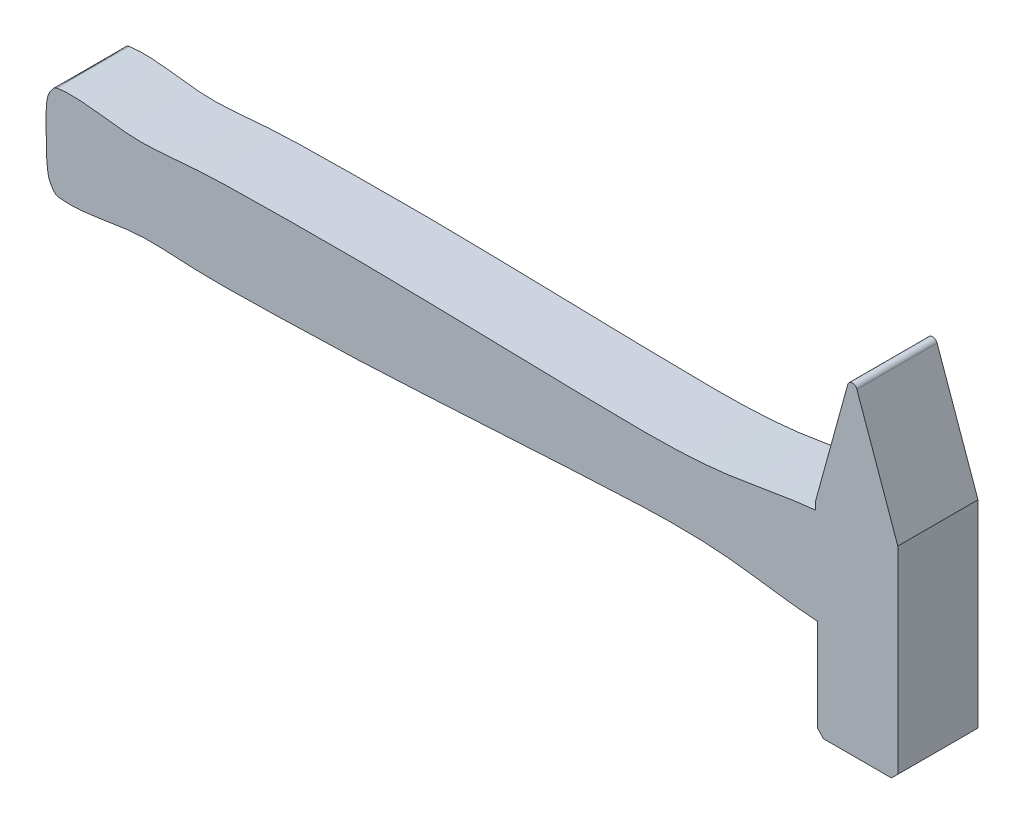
ISO-10303-21;
HEADER;
FILE_DESCRIPTION(('STEP AP214'),'2;1');
FILE_NAME('part.step','',(''),(''),'','','');
FILE_SCHEMA(('AUTOMOTIVE_DESIGN { 1 0 10303 214 1 1 1 1 }'));
ENDSEC;
DATA;
#1=APPLICATION_CONTEXT('core data for automotive mechanical design processes');
#2=APPLICATION_PROTOCOL_DEFINITION('international standard','automotive_design',2000,#1);
#3=PRODUCT_CONTEXT('',#1,'mechanical');
#4=PRODUCT('Part','Part','',(#3));
#5=PRODUCT_RELATED_PRODUCT_CATEGORY('part','',(#4));
#6=PRODUCT_DEFINITION_FORMATION('','',#4);
#7=PRODUCT_DEFINITION_CONTEXT('part definition',#1,'design');
#8=PRODUCT_DEFINITION('design','',#6,#7);
#9=PRODUCT_DEFINITION_SHAPE('','',#8);
#10=(LENGTH_UNIT() NAMED_UNIT(*) SI_UNIT(.MILLI.,.METRE.));
#11=(NAMED_UNIT(*) PLANE_ANGLE_UNIT() SI_UNIT($,.RADIAN.));
#12=(NAMED_UNIT(*) SI_UNIT($,.STERADIAN.) SOLID_ANGLE_UNIT());
#13=UNCERTAINTY_MEASURE_WITH_UNIT(LENGTH_MEASURE(1.E-05),#10,'distance_accuracy_value','');
#14=(GEOMETRIC_REPRESENTATION_CONTEXT(3) GLOBAL_UNCERTAINTY_ASSIGNED_CONTEXT((#13)) GLOBAL_UNIT_ASSIGNED_CONTEXT((#10,
#11,#12)) REPRESENTATION_CONTEXT('',''));
#15=CARTESIAN_POINT('',(0.,0.,0.));
#16=DIRECTION('',(0.,0.,1.));
#17=DIRECTION('',(1.,0.,0.));
#18=AXIS2_PLACEMENT_3D('',#15,#16,#17);
#19=CARTESIAN_POINT('',(-0.68450806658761,78.1907628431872,33.4));
#20=CARTESIAN_POINT('',(-13.6434926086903,76.9835073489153,33.4));
#21=CARTESIAN_POINT('',(-33.3766329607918,72.3930161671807,33.4));
#22=CARTESIAN_POINT('',(-62.7810656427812,70.5584136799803,33.4));
#23=CARTESIAN_POINT('',(-93.440673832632,70.9978990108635,33.4));
#24=CARTESIAN_POINT('',(-138.176641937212,71.9057039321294,33.4));
#25=CARTESIAN_POINT('',(-185.927046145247,73.2892298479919,33.4));
#26=CARTESIAN_POINT('',(-229.529665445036,72.8733691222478,33.4));
#27=CARTESIAN_POINT('',(-259.40709066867,72.4489903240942,33.4));
#28=CARTESIAN_POINT('',(-283.728884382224,69.4231372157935,33.4));
#29=CARTESIAN_POINT('',(-301.923274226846,72.7541457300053,33.4));
#30=CARTESIAN_POINT('',(-312.704353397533,73.0430645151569,33.4));
#31=CARTESIAN_POINT('',(-316.828381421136,72.4242011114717,33.4));
#32=B_SPLINE_CURVE_WITH_KNOTS('',3,(#19,#20,#21,#22,#23,#24,#25,#26,#27,#28,#29,#30,#31),
.UNSPECIFIED.,.F.,.F.,(4,1,1,1,1,1,1,1,1,1,4),(0.,0.123173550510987,0.190951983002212,
0.27844417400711,0.413498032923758,0.614695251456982,0.730775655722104,0.826275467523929,
0.897914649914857,0.961054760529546,1.),.UNSPECIFIED.);
#33=DIRECTION('',(0.,0.,-1.));
#34=VECTOR('',#33,1.);
#35=SURFACE_OF_LINEAR_EXTRUSION('',#32,#34);
#36=CARTESIAN_POINT('',(-316.828381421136,72.4242011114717,3.33));
#37=CARTESIAN_POINT('',(-316.334623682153,72.4983284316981,3.33));
#38=CARTESIAN_POINT('',(-315.839387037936,72.5621855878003,3.33));
#39=CARTESIAN_POINT('',(-314.849201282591,72.670468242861,3.33));
#40=CARTESIAN_POINT('',(-314.354262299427,72.7149859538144,3.33));
#41=CARTESIAN_POINT('',(-313.3647027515,72.7862738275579,3.33));
#42=CARTESIAN_POINT('',(-312.870086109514,72.8130995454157,3.33));
#43=CARTESIAN_POINT('',(-311.881159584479,72.8507289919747,3.33));
#44=CARTESIAN_POINT('',(-311.386850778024,72.8615617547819,3.33));
#45=CARTESIAN_POINT('',(-310.398535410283,72.8689061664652,3.33));
#46=CARTESIAN_POINT('',(-309.904528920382,72.8654291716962,3.33));
#47=CARTESIAN_POINT('',(-308.916809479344,72.8458492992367,3.33));
#48=CARTESIAN_POINT('',(-308.423096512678,72.8297471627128,3.33));
#49=CARTESIAN_POINT('',(-307.436091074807,72.7866145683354,3.33));
#50=CARTESIAN_POINT('',(-306.942798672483,72.7595825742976,3.33));
#51=CARTESIAN_POINT('',(-305.956446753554,72.6962603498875,3.33));
#52=CARTESIAN_POINT('',(-305.463387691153,72.6599631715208,3.33));
#53=CARTESIAN_POINT('',(-304.477458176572,72.579827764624,3.33));
#54=CARTESIAN_POINT('',(-303.984588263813,72.5359829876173,3.33));
#55=CARTESIAN_POINT('',(-302.999019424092,72.4421601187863,3.33));
#56=CARTESIAN_POINT('',(-302.506320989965,72.3921768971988,3.33));
#57=CARTESIAN_POINT('',(-301.521092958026,72.2873499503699,3.33));
#58=CARTESIAN_POINT('',(-301.028563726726,72.232502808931,3.33));
#59=CARTESIAN_POINT('',(-300.043668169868,72.119258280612,3.33));
#60=CARTESIAN_POINT('',(-299.551302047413,72.0608591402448,3.33));
#61=CARTESIAN_POINT('',(-298.262526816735,71.9050344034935,3.33));
#62=CARTESIAN_POINT('',(-297.466338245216,71.805802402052,3.33));
#63=CARTESIAN_POINT('',(-295.874167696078,71.6069783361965,3.33));
#64=CARTESIAN_POINT('',(-295.078185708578,71.50738634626,3.33));
#65=CARTESIAN_POINT('',(-293.48620579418,71.3133647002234,3.33));
#66=CARTESIAN_POINT('',(-292.690208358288,71.2189311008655,3.33));
#67=CARTESIAN_POINT('',(-291.097982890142,71.0407616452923,3.33));
#68=CARTESIAN_POINT('',(-290.301756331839,70.957012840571,3.33));
#69=CARTESIAN_POINT('',(-288.708831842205,70.8057505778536,3.33));
#70=CARTESIAN_POINT('',(-287.912136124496,70.7382145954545,3.33));
#71=CARTESIAN_POINT('',(-286.716383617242,70.6532399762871,3.33));
#72=CARTESIAN_POINT('',(-286.317903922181,70.6276464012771,3.33));
#73=CARTESIAN_POINT('',(-285.520598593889,70.5825683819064,3.33));
#74=CARTESIAN_POINT('',(-285.121772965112,70.5630838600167,3.33));
#75=CARTESIAN_POINT('',(-284.323664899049,70.5309856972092,3.33));
#76=CARTESIAN_POINT('',(-283.924382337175,70.5183751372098,3.33));
#77=CARTESIAN_POINT('',(-283.125665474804,70.499664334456,3.33));
#78=CARTESIAN_POINT('',(-282.726231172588,70.4935641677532,3.33));
#79=CARTESIAN_POINT('',(-281.527241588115,70.4842793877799,3.33));
#80=CARTESIAN_POINT('',(-280.727607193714,70.4901335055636,3.33));
#81=CARTESIAN_POINT('',(-279.127807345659,70.5221191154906,3.33));
#82=CARTESIAN_POINT('',(-278.327642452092,70.548275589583,3.33));
#83=CARTESIAN_POINT('',(-276.726998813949,70.6170648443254,3.33));
#84=CARTESIAN_POINT('',(-275.926521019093,70.6597190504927,3.33));
#85=CARTESIAN_POINT('',(-274.325494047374,70.7577088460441,3.33));
#86=CARTESIAN_POINT('',(-273.524945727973,70.8130580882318,3.33));
#87=CARTESIAN_POINT('',(-272.324378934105,70.9027372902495,3.33));
#88=CARTESIAN_POINT('',(-271.924106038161,70.9337504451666,3.33));
#89=CARTESIAN_POINT('',(-271.12369597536,70.9975208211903,3.33));
#90=CARTESIAN_POINT('',(-270.7235588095,71.0302780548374,3.33));
#91=CARTESIAN_POINT('',(-269.526465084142,71.1301970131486,3.33));
#92=CARTESIAN_POINT('',(-268.729667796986,71.1992494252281,3.33));
#93=CARTESIAN_POINT('',(-267.13618745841,71.3387212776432,3.33));
#94=CARTESIAN_POINT('',(-266.339504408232,71.4091407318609,3.33));
#95=CARTESIAN_POINT('',(-265.144342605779,71.5130361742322,3.33));
#96=CARTESIAN_POINT('',(-264.74593994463,71.5473784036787,3.33));
#97=CARTESIAN_POINT('',(-263.949046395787,71.6150244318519,3.33));
#98=CARTESIAN_POINT('',(-263.55055550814,71.648328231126,3.33));
#99=CARTESIAN_POINT('',(-262.753455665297,71.7134370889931,3.33));
#100=CARTESIAN_POINT('',(-262.354846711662,71.7452421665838,3.33));
#101=CARTESIAN_POINT('',(-261.557476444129,71.8068831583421,3.33));
#102=CARTESIAN_POINT('',(-261.158715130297,71.8367190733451,3.33));
#103=CARTESIAN_POINT('',(-260.361789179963,71.8944333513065,3.33));
#104=CARTESIAN_POINT('',(-259.963624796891,71.9223152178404,3.33));
#105=CARTESIAN_POINT('',(-259.167172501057,71.976256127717,3.33));
#106=CARTESIAN_POINT('',(-258.768884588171,72.0023151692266,3.33));
#107=CARTESIAN_POINT('',(-257.573845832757,72.0778672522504,3.33));
#108=CARTESIAN_POINT('',(-256.776927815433,72.1247346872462,3.33));
#109=CARTESIAN_POINT('',(-255.182692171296,72.2120599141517,3.33));
#110=CARTESIAN_POINT('',(-254.385374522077,72.25251729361,3.33));
#111=CARTESIAN_POINT('',(-252.790470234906,72.3276138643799,3.33));
#112=CARTESIAN_POINT('',(-251.992883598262,72.3622530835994,3.33));
#113=CARTESIAN_POINT('',(-250.398247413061,72.4262832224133,3.33));
#114=CARTESIAN_POINT('',(-249.601198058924,72.4556790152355,3.33));
#115=CARTESIAN_POINT('',(-248.006942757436,72.5098637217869,3.33));
#116=CARTESIAN_POINT('',(-247.209736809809,72.5346526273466,3.33));
#117=CARTESIAN_POINT('',(-244.817993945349,72.60301186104,3.33));
#118=CARTESIAN_POINT('',(-243.223285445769,72.6405765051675,3.33));
#119=CARTESIAN_POINT('',(-240.034190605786,72.7045401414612,3.33));
#120=CARTESIAN_POINT('',(-238.439804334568,72.730942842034,3.33));
#121=CARTESIAN_POINT('',(-235.250936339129,72.7774240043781,3.33));
#122=CARTESIAN_POINT('',(-233.656454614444,72.7975024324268,3.33));
#123=CARTESIAN_POINT('',(-231.26491318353,72.8266205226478,3.33));
#124=CARTESIAN_POINT('',(-230.467858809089,72.8361588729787,3.33));
#125=CARTESIAN_POINT('',(-228.87374789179,72.8549242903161,3.33));
#126=CARTESIAN_POINT('',(-228.076691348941,72.8641513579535,3.33));
#127=CARTESIAN_POINT('',(-225.68551833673,72.8912137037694,3.33));
#128=CARTESIAN_POINT('',(-224.091394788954,72.9084301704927,3.33));
#129=CARTESIAN_POINT('',(-220.903238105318,72.9406092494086,3.33));
#130=CARTESIAN_POINT('',(-219.309204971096,72.9555720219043,3.33));
#131=CARTESIAN_POINT('',(-216.121112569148,72.982619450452,3.33));
#132=CARTESIAN_POINT('',(-214.527053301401,72.994704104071,3.33));
#133=CARTESIAN_POINT('',(-211.337702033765,73.0153832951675,3.33));
#134=CARTESIAN_POINT('',(-209.742410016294,73.0239751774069,3.33));
#135=CARTESIAN_POINT('',(-206.551808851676,73.0370334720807,3.33));
#136=CARTESIAN_POINT('',(-204.95649970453,73.0414998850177,3.33));
#137=CARTESIAN_POINT('',(-201.765512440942,73.0456818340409,3.33));
#138=CARTESIAN_POINT('',(-200.169834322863,73.0453962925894,3.33));
#139=CARTESIAN_POINT('',(-197.776325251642,73.0409431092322,3.33));
#140=CARTESIAN_POINT('',(-196.978490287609,73.0387879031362,3.33));
#141=CARTESIAN_POINT('',(-195.382825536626,73.0330437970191,3.33));
#142=CARTESIAN_POINT('',(-194.584995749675,73.0294548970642,3.33));
#143=CARTESIAN_POINT('',(-192.191161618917,73.0165273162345,3.33));
#144=CARTESIAN_POINT('',(-190.595168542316,73.0050283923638,3.33));
#145=CARTESIAN_POINT('',(-187.403228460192,72.9768434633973,3.33));
#146=CARTESIAN_POINT('',(-185.807281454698,72.9601574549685,3.33));
#147=CARTESIAN_POINT('',(-181.018793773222,72.9030951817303,3.33));
#148=CARTESIAN_POINT('',(-177.826335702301,72.8557190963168,3.33));
#149=CARTESIAN_POINT('',(-171.440984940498,72.7465698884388,3.33));
#150=CARTESIAN_POINT('',(-168.248092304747,72.6847936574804,3.33));
#151=CARTESIAN_POINT('',(-161.861935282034,72.5511084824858,3.33));
#152=CARTESIAN_POINT('',(-158.668670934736,72.4791976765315,3.33));
#153=CARTESIAN_POINT('',(-153.317863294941,72.3537971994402,3.33));
#154=CARTESIAN_POINT('',(-151.160281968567,72.3018966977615,3.33));
#155=CARTESIAN_POINT('',(-146.84515192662,72.1967429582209,3.33));
#156=CARTESIAN_POINT('',(-144.687603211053,72.1434897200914,3.33));
#157=CARTESIAN_POINT('',(-140.372508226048,72.0369523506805,3.33));
#158=CARTESIAN_POINT('',(-138.214961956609,71.9836682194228,3.33));
#159=CARTESIAN_POINT('',(-134.978619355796,71.9046980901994,3.33));
#160=CARTESIAN_POINT('',(-133.899834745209,71.8785340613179,3.33));
#161=CARTESIAN_POINT('',(-131.74225353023,71.82670573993,3.33));
#162=CARTESIAN_POINT('',(-130.663456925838,71.8010414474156,3.33));
#163=CARTESIAN_POINT('',(-127.427543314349,71.7249279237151,3.33));
#164=CARTESIAN_POINT('',(-125.270405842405,71.6753458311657,3.33));
#165=CARTESIAN_POINT('',(-120.956079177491,71.5784632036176,3.33));
#166=CARTESIAN_POINT('',(-118.798889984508,71.5311626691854,3.33));
#167=CARTESIAN_POINT('',(-114.485435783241,71.4388887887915,3.33));
#168=CARTESIAN_POINT('',(-112.329170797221,71.3939144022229,3.33));
#169=CARTESIAN_POINT('',(-108.016594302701,71.3062795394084,3.33));
#170=CARTESIAN_POINT('',(-105.860282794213,71.2636190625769,3.33));
#171=CARTESIAN_POINT('',(-102.626505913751,71.2013881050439,3.33));
#172=CARTESIAN_POINT('',(-101.54905728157,71.1809443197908,3.33));
#173=CARTESIAN_POINT('',(-99.394149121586,71.140639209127,3.33));
#174=CARTESIAN_POINT('',(-98.3166895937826,71.1207778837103,3.33));
#175=CARTESIAN_POINT('',(-96.1617595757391,71.0816401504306,3.33));
#176=CARTESIAN_POINT('',(-95.0842890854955,71.0623637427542,3.33));
#177=CARTESIAN_POINT('',(-92.9293378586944,71.0243941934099,3.33));
#178=CARTESIAN_POINT('',(-91.8518571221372,71.0057010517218,3.33));
#179=CARTESIAN_POINT('',(-90.2361048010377,70.9781171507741,3.33));
#180=CARTESIAN_POINT('',(-89.6978370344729,70.9690024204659,3.33));
#181=CARTESIAN_POINT('',(-88.6212992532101,70.9509067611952,3.33));
#182=CARTESIAN_POINT('',(-88.0830292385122,70.9419258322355,3.33));
#183=CARTESIAN_POINT('',(-86.4682130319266,70.915313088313,3.33));
#184=CARTESIAN_POINT('',(-85.3916612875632,70.8980113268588,3.33));
#185=CARTESIAN_POINT('',(-83.2385172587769,70.8655213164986,3.33));
#186=CARTESIAN_POINT('',(-82.1619249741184,70.8503330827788,3.33));
#187=CARTESIAN_POINT('',(-80.0086997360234,70.8232557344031,3.33));
#188=CARTESIAN_POINT('',(-78.9320667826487,70.8113666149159,3.33));
#189=CARTESIAN_POINT('',(-76.4199242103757,70.7888731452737,3.33));
#190=CARTESIAN_POINT('',(-74.9843976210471,70.7800176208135,3.33));
#191=CARTESIAN_POINT('',(-72.1133216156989,70.7731361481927,3.33));
#192=CARTESIAN_POINT('',(-70.6777721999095,70.7751101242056,3.33));
#193=CARTESIAN_POINT('',(-67.806755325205,70.7927210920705,3.33));
#194=CARTESIAN_POINT('',(-66.3712878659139,70.808358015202,3.33));
#195=CARTESIAN_POINT('',(-63.5023263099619,70.8560931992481,3.33));
#196=CARTESIAN_POINT('',(-62.0688318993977,70.8881718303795,3.33));
#197=CARTESIAN_POINT('',(-59.2023703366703,70.9715799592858,3.33));
#198=CARTESIAN_POINT('',(-57.7694031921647,71.0229097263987,3.33));
#199=CARTESIAN_POINT('',(-54.9043408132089,71.1477166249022,3.33));
#200=CARTESIAN_POINT('',(-53.4722456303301,71.2211949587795,3.33));
#201=CARTESIAN_POINT('',(-50.6094156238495,71.3932232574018,3.33));
#202=CARTESIAN_POINT('',(-49.1786809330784,71.491775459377,3.33));
#203=CARTESIAN_POINT('',(-46.3194607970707,71.7168580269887,3.33));
#204=CARTESIAN_POINT('',(-44.8909752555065,71.8433871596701,3.33));
#205=CARTESIAN_POINT('',(-42.0372723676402,72.1273742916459,3.33));
#206=CARTESIAN_POINT('',(-40.6120545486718,72.2848274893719,3.33));
#207=CARTESIAN_POINT('',(-37.7611297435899,72.6339785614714,3.33));
#208=CARTESIAN_POINT('',(-36.3354362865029,72.825786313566,3.33));
#209=CARTESIAN_POINT('',(-33.4875254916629,73.2345846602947,3.33));
#210=CARTESIAN_POINT('',(-32.0653086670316,73.4515787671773,3.33));
#211=CARTESIAN_POINT('',(-29.2233691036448,73.9022583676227,3.33));
#212=CARTESIAN_POINT('',(-27.803646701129,74.1359459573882,3.33));
#213=CARTESIAN_POINT('',(-24.9609820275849,74.6122742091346,3.33));
#214=CARTESIAN_POINT('',(-23.5380442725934,74.8549414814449,3.33));
#215=CARTESIAN_POINT('',(-20.6923167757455,75.3399643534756,3.33));
#216=CARTESIAN_POINT('',(-19.2695270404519,75.5823199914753,3.33));
#217=CARTESIAN_POINT('',(-16.4227044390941,76.0581986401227,3.33));
#218=CARTESIAN_POINT('',(-14.9986718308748,76.2917231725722,3.33));
#219=CARTESIAN_POINT('',(-12.1471369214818,76.7415449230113,3.33));
#220=CARTESIAN_POINT('',(-10.7196332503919,76.9578335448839,3.33));
#221=CARTESIAN_POINT('',(-7.86056692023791,77.364463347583,3.33));
#222=CARTESIAN_POINT('',(-6.42900351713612,77.5547994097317,3.33));
#223=CARTESIAN_POINT('',(-3.56055293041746,77.9009360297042,3.33));
#224=CARTESIAN_POINT('',(-2.12366234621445,78.0567081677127,3.33));
#225=CARTESIAN_POINT('',(-0.68450806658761,78.1907628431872,3.33));
#226=B_SPLINE_CURVE_WITH_KNOTS('',3,(#36,#37,#38,#39,#40,#41,#42,#43,#44,#45,#46,#47,#48,#49,
#50,#51,#52,#53,#54,#55,#56,#57,#58,#59,#60,#61,#62,#63,#64,#65,#66,#67,#68,#69,#70,#71,#72,#73,
#74,#75,#76,#77,#78,#79,#80,#81,#82,#83,#84,#85,#86,#87,#88,#89,#90,#91,#92,#93,#94,#95,#96,#97,
#98,#99,#100,#101,#102,#103,#104,#105,#106,#107,#108,#109,#110,#111,#112,#113,#114,#115,#116,
#117,#118,#119,#120,#121,#122,#123,#124,#125,#126,#127,#128,#129,#130,#131,#132,#133,#134,#135,
#136,#137,#138,#139,#140,#141,#142,#143,#144,#145,#146,#147,#148,#149,#150,#151,#152,#153,#154,
#155,#156,#157,#158,#159,#160,#161,#162,#163,#164,#165,#166,#167,#168,#169,#170,#171,#172,#173,
#174,#175,#176,#177,#178,#179,#180,#181,#182,#183,#184,#185,#186,#187,#188,#189,#190,#191,#192,
#193,#194,#195,#196,#197,#198,#199,#200,#201,#202,#203,#204,#205,#206,#207,#208,#209,#210,#211,
#212,#213,#214,#215,#216,#217,#218,#219,#220,#221,#222,#223,#224,#225),.UNSPECIFIED.,.F.,.F.,(4,
2,2,2,2,2,2,2,2,2,2,2,2,2,2,2,2,2,2,2,2,2,2,2,2,2,2,2,2,2,2,2,2,2,2,2,2,2,2,2,2,2,2,2,2,2,2,2,2,
2,2,2,2,2,2,2,2,2,2,2,2,2,2,2,2,2,2,2,2,2,2,2,2,2,2,2,2,2,2,2,2,2,2,2,2,2,2,2,2,2,2,2,2,2,4),
(0.,1.49767503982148,2.98812850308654,4.47387918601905,5.95692926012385,7.43880259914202,
8.9205889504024,10.4025836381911,11.8856929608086,13.3700956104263,14.8557472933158,
16.3424508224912,17.8298943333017,20.2369327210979,22.6434987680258,25.0481986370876,
27.4499560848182,29.8483572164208,31.0462212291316,32.2440700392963,33.4424552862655,
34.6408545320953,37.0394762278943,39.4410541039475,41.845761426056,44.2530671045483,
45.457482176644,46.661905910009,49.0612500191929,51.4606185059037,52.6602577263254,
53.8598963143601,55.0595196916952,56.2591425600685,57.4565563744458,58.6539713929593,
61.0488250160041,63.4438326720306,65.8388288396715,68.2315873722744,70.624350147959,
75.4097359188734,80.1935305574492,84.9773507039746,87.3686852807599,89.7600150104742,
94.5426633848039,99.3249714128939,104.10728348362,108.893224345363,113.679164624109,
118.46619016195,120.859702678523,123.253215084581,128.041308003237,132.829403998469,
142.407783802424,151.988233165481,161.570444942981,168.045060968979,174.519678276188,
180.994290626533,184.231596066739,187.468901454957,193.942021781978,200.415143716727,
206.885344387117,213.355543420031,216.588470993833,219.821398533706,223.0543271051,
226.287255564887,227.902290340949,229.517325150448,232.747396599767,235.977491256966,
239.207581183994,243.514212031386,247.820812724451,252.127391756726,256.428841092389,
260.730350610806,265.032093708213,269.334220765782,273.636158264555,277.937428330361,
282.252709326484,286.568592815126,290.885019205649,295.215463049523,299.54531124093,
303.874409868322,308.205654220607,312.537751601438,316.87339791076),.UNSPECIFIED.);
#227=CARTESIAN_POINT('',(-316.828381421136,72.4242011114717,3.33));
#228=VERTEX_POINT('',#227);
#229=CARTESIAN_POINT('',(-0.68450806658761,78.1907628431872,3.33));
#230=VERTEX_POINT('',#229);
#231=EDGE_CURVE('E152',#228,#230,#226,.T.);
#232=ORIENTED_EDGE('',*,*,#231,.F.);
#233=DIRECTION('',(0.,0.,-1.));
#234=VECTOR('',#233,1.);
#235=CARTESIAN_POINT('',(-316.828381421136,72.4242011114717,33.4));
#236=LINE('',#235,#234);
#237=CARTESIAN_POINT('',(-316.828381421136,72.4242011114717,33.4));
#238=VERTEX_POINT('',#237);
#239=EDGE_CURVE('E180',#238,#228,#236,.T.);
#240=ORIENTED_EDGE('',*,*,#239,.F.);
#241=CARTESIAN_POINT('',(-0.68450806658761,78.1907628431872,33.4));
#242=VERTEX_POINT('',#241);
#243=EDGE_CURVE('E177',#242,#238,#32,.T.);
#244=ORIENTED_EDGE('',*,*,#243,.F.);
#245=DIRECTION('',(0.,0.,-1.));
#246=VECTOR('',#245,1.);
#247=CARTESIAN_POINT('',(-0.68450806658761,78.1907628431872,33.4));
#248=LINE('',#247,#246);
#249=EDGE_CURVE('E169',#242,#230,#248,.T.);
#250=ORIENTED_EDGE('',*,*,#249,.T.);
#251=EDGE_LOOP('',(#232,#240,#244,#250));
#252=FACE_BOUND('',#251,.T.);
#253=ADVANCED_FACE('F39',(#252),#35,.F.);
#254=CARTESIAN_POINT('',(-316.828381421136,72.4242011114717,33.4));
#255=CARTESIAN_POINT('',(-317.577160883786,72.3118371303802,33.4));
#256=CARTESIAN_POINT('',(-318.841511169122,71.029543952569,33.4));
#257=CARTESIAN_POINT('',(-320.809336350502,67.9434531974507,33.4));
#258=CARTESIAN_POINT('',(-321.463284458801,61.4325346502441,33.4));
#259=CARTESIAN_POINT('',(-321.320797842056,56.2054246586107,33.4));
#260=CARTESIAN_POINT('',(-321.218635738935,52.8135249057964,33.4));
#261=B_SPLINE_CURVE_WITH_KNOTS('',3,(#254,#255,#256,#257,#258,#259,#260),.UNSPECIFIED.,.F.,.F.,
(4,1,1,1,4),(0.,0.100752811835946,0.240872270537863,0.52065498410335,1.),.UNSPECIFIED.);
#262=DIRECTION('',(0.,0.,-1.));
#263=VECTOR('',#262,1.);
#264=SURFACE_OF_LINEAR_EXTRUSION('',#261,#263);
#265=CARTESIAN_POINT('',(-321.218635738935,52.8135249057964,3.33));
#266=CARTESIAN_POINT('',(-321.228080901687,53.1271658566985,3.33));
#267=CARTESIAN_POINT('',(-321.237448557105,53.4408099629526,3.33));
#268=CARTESIAN_POINT('',(-321.255587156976,54.0681465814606,3.33));
#269=CARTESIAN_POINT('',(-321.264358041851,54.3818390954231,3.33));
#270=CARTESIAN_POINT('',(-321.280859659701,55.0092640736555,3.33));
#271=CARTESIAN_POINT('',(-321.288590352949,55.3229965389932,3.33));
#272=CARTESIAN_POINT('',(-321.30253258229,55.9491780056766,3.33));
#273=CARTESIAN_POINT('',(-321.308750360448,56.2616268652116,3.33));
#274=CARTESIAN_POINT('',(-321.319265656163,56.886547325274,3.33));
#275=CARTESIAN_POINT('',(-321.323563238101,57.1990189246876,3.33));
#276=CARTESIAN_POINT('',(-321.329800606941,57.8239767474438,3.33));
#277=CARTESIAN_POINT('',(-321.331740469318,58.136462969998,3.33));
#278=CARTESIAN_POINT('',(-321.332834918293,58.7615000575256,3.33));
#279=CARTESIAN_POINT('',(-321.331988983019,59.0740509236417,3.33));
#280=CARTESIAN_POINT('',(-321.327098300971,59.6991373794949,3.33));
#281=CARTESIAN_POINT('',(-321.32305346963,60.0116729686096,3.33));
#282=CARTESIAN_POINT('',(-321.311369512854,60.6367020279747,3.33));
#283=CARTESIAN_POINT('',(-321.303730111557,60.9491954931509,3.33));
#284=CARTESIAN_POINT('',(-321.284445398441,61.575727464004,3.33));
#285=CARTESIAN_POINT('',(-321.272778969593,61.8897653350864,3.33));
#286=CARTESIAN_POINT('',(-321.252001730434,62.3606724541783,3.33));
#287=CARTESIAN_POINT('',(-321.244529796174,62.5176152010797,3.33));
#288=CARTESIAN_POINT('',(-321.228492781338,62.8314453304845,3.33));
#289=CARTESIAN_POINT('',(-321.219927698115,62.9883327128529,3.33));
#290=CARTESIAN_POINT('',(-321.201457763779,63.3020263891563,3.33));
#291=CARTESIAN_POINT('',(-321.191552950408,63.4588326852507,3.33));
#292=CARTESIAN_POINT('',(-321.169891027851,63.7723158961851,3.33));
#293=CARTESIAN_POINT('',(-321.15813391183,63.9289928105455,3.33));
#294=CARTESIAN_POINT('',(-321.11440040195,64.4593352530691,3.33));
#295=CARTESIAN_POINT('',(-321.076995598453,64.832593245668,3.33));
#296=CARTESIAN_POINT('',(-320.982279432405,65.5768107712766,3.33));
#297=CARTESIAN_POINT('',(-320.924962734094,65.9477696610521,3.33));
#298=CARTESIAN_POINT('',(-320.783830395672,66.6812207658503,3.33));
#299=CARTESIAN_POINT('',(-320.700264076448,67.0437595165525,3.33));
#300=CARTESIAN_POINT('',(-320.499183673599,67.7592512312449,3.33));
#301=CARTESIAN_POINT('',(-320.381711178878,68.112215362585,3.33));
#302=CARTESIAN_POINT('',(-320.193721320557,68.5829772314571,3.33));
#303=CARTESIAN_POINT('',(-320.1407129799,68.7078698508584,3.33));
#304=CARTESIAN_POINT('',(-320.029175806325,68.9551862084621,3.33));
#305=CARTESIAN_POINT('',(-319.970646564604,69.0776097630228,3.33));
#306=CARTESIAN_POINT('',(-319.848389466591,69.3198380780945,3.33));
#307=CARTESIAN_POINT('',(-319.784661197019,69.4396426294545,3.33));
#308=CARTESIAN_POINT('',(-319.651998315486,69.6770199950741,3.33));
#309=CARTESIAN_POINT('',(-319.583042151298,69.7945807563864,3.33));
#310=CARTESIAN_POINT('',(-319.440490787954,70.0268414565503,3.33));
#311=CARTESIAN_POINT('',(-319.366895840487,70.1415415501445,3.33));
#312=CARTESIAN_POINT('',(-319.21540358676,70.3680122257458,3.33));
#313=CARTESIAN_POINT('',(-319.13750761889,70.4797837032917,3.33));
#314=CARTESIAN_POINT('',(-319.007173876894,70.6597415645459,3.33));
#315=CARTESIAN_POINT('',(-318.955938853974,70.7288035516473,3.33));
#316=CARTESIAN_POINT('',(-318.851948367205,70.8657832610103,3.33));
#317=CARTESIAN_POINT('',(-318.799192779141,70.933700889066,3.33));
#318=CARTESIAN_POINT('',(-318.69220222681,71.0684245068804,3.33));
#319=CARTESIAN_POINT('',(-318.637966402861,71.1352298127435,3.33));
#320=CARTESIAN_POINT('',(-318.528203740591,71.2676696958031,3.33));
#321=CARTESIAN_POINT('',(-318.47267814,71.3333052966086,3.33));
#322=CARTESIAN_POINT('',(-318.359471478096,71.462657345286,3.33));
#323=CARTESIAN_POINT('',(-318.301791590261,71.5263748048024,3.33));
#324=CARTESIAN_POINT('',(-318.183455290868,71.6508920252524,3.33));
#325=CARTESIAN_POINT('',(-318.122800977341,71.7116937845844,3.33));
#326=CARTESIAN_POINT('',(-317.963732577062,71.861138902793,3.33));
#327=CARTESIAN_POINT('',(-317.8626367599,71.9470572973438,3.33));
#328=CARTESIAN_POINT('',(-317.702891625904,72.0642653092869,3.33));
#329=CARTESIAN_POINT('',(-317.648453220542,72.1013040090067,3.33));
#330=CARTESIAN_POINT('',(-317.53673151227,72.1707788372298,3.33));
#331=CARTESIAN_POINT('',(-317.479450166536,72.203218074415,3.33));
#332=CARTESIAN_POINT('',(-317.374689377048,72.2563300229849,3.33));
#333=CARTESIAN_POINT('',(-317.327732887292,72.2780355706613,3.33));
#334=CARTESIAN_POINT('',(-317.232284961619,72.3177505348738,3.33));
#335=CARTESIAN_POINT('',(-317.183793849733,72.335760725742,3.33));
#336=CARTESIAN_POINT('',(-317.084746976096,72.3680491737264,3.33));
#337=CARTESIAN_POINT('',(-317.034170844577,72.3822651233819,3.33));
#338=CARTESIAN_POINT('',(-316.931969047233,72.4064573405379,3.33));
#339=CARTESIAN_POINT('',(-316.880342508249,72.4164299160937,3.33));
#340=CARTESIAN_POINT('',(-316.828381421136,72.4242011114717,3.33));
#341=B_SPLINE_CURVE_WITH_KNOTS('',3,(#265,#266,#267,#268,#269,#270,#271,#272,#273,#274,#275,
#276,#277,#278,#279,#280,#281,#282,#283,#284,#285,#286,#287,#288,#289,#290,#291,#292,#293,#294,
#295,#296,#297,#298,#299,#300,#301,#302,#303,#304,#305,#306,#307,#308,#309,#310,#311,#312,#313,
#314,#315,#316,#317,#318,#319,#320,#321,#322,#323,#324,#325,#326,#327,#328,#329,#330,#331,#332,
#333,#334,#335,#336,#337,#338,#339,#340),.UNSPECIFIED.,.F.,.F.,(4,2,2,2,2,2,2,2,2,2,2,2,2,2,2,2,
2,2,2,2,2,2,2,2,2,2,2,2,2,2,2,2,2,2,2,2,2,4),(0.,0.94135073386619,1.88279530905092,
2.82427582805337,3.76180343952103,4.69929961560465,5.63676578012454,6.57440757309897,
7.51207415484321,8.44981270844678,9.3925452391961,9.86390342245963,10.3352627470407,
10.8066087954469,11.2779565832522,12.4029783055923,13.5283017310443,14.6432444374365,
15.7568253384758,16.1637435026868,16.5706918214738,16.9776725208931,17.3864332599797,
17.7951718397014,18.2037839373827,18.4617403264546,18.7197178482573,18.9778485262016,
19.2357409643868,19.4934949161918,19.7510696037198,20.1479361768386,20.3452904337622,
20.5425106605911,20.6975619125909,20.8525806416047,21.0100070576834,21.1675701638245),.UNSPECIFIED.);
#342=CARTESIAN_POINT('',(-321.218635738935,52.8135249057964,3.33));
#343=VERTEX_POINT('',#342);
#344=EDGE_CURVE('E157',#343,#228,#341,.T.);
#345=ORIENTED_EDGE('',*,*,#344,.F.);
#346=DIRECTION('',(0.,0.,-1.));
#347=VECTOR('',#346,1.);
#348=CARTESIAN_POINT('',(-321.218635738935,52.8135249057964,33.4));
#349=LINE('',#348,#347);
#350=CARTESIAN_POINT('',(-321.218635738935,52.8135249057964,33.4));
#351=VERTEX_POINT('',#350);
#352=EDGE_CURVE('E186',#351,#343,#349,.T.);
#353=ORIENTED_EDGE('',*,*,#352,.F.);
#354=EDGE_CURVE('E259',#238,#351,#261,.T.);
#355=ORIENTED_EDGE('',*,*,#354,.F.);
#356=ORIENTED_EDGE('',*,*,#239,.T.);
#357=EDGE_LOOP('',(#345,#353,#355,#356));
#358=FACE_BOUND('',#357,.T.);
#359=ADVANCED_FACE('F258',(#358),#264,.F.);
#360=CARTESIAN_POINT('',(-321.218635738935,52.8135249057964,33.4));
#361=CARTESIAN_POINT('',(-321.203762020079,49.4201195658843,33.4));
#362=CARTESIAN_POINT('',(-321.165898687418,44.1912049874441,33.4));
#363=CARTESIAN_POINT('',(-320.287800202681,37.7067118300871,33.4));
#364=CARTESIAN_POINT('',(-318.214716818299,34.6903203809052,33.4));
#365=CARTESIAN_POINT('',(-316.906896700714,33.4523930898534,33.4));
#366=CARTESIAN_POINT('',(-316.154687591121,33.3659187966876,33.4));
#367=B_SPLINE_CURVE_WITH_KNOTS('',3,(#360,#361,#362,#363,#364,#365,#366),.UNSPECIFIED.,.F.,.F.,
(4,1,1,1,4),(0.,0.479345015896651,0.759127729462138,0.899247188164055,1.),.UNSPECIFIED.);
#368=DIRECTION('',(0.,0.,-1.));
#369=VECTOR('',#368,1.);
#370=SURFACE_OF_LINEAR_EXTRUSION('',#367,#369);
#371=CARTESIAN_POINT('',(-316.154687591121,33.3659187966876,3.33));
#372=CARTESIAN_POINT('',(-316.211887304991,33.3724569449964,3.33));
#373=CARTESIAN_POINT('',(-316.268772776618,33.3816623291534,3.33));
#374=CARTESIAN_POINT('',(-316.38139154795,33.4051927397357,3.33));
#375=CARTESIAN_POINT('',(-316.437126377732,33.4195104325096,3.33));
#376=CARTESIAN_POINT('',(-316.545739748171,33.4526595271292,3.33));
#377=CARTESIAN_POINT('',(-316.598654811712,33.4713718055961,3.33));
#378=CARTESIAN_POINT('',(-316.702772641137,33.5131009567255,3.33));
#379=CARTESIAN_POINT('',(-316.753974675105,33.5361196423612,3.33));
#380=CARTESIAN_POINT('',(-316.873490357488,33.5954327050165,3.33));
#381=CARTESIAN_POINT('',(-316.940947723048,33.6334546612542,3.33));
#382=CARTESIAN_POINT('',(-317.072121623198,33.7154365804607,3.33));
#383=CARTESIAN_POINT('',(-317.135837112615,33.7593981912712,3.33));
#384=CARTESIAN_POINT('',(-317.260550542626,33.8525675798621,3.33));
#385=CARTESIAN_POINT('',(-317.321503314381,33.9018352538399,3.33));
#386=CARTESIAN_POINT('',(-317.440271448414,34.0040063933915,3.33));
#387=CARTESIAN_POINT('',(-317.498086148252,34.0569106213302,3.33));
#388=CARTESIAN_POINT('',(-317.604130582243,34.1586747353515,3.33));
#389=CARTESIAN_POINT('',(-317.652660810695,34.2072244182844,3.33));
#390=CARTESIAN_POINT('',(-317.748146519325,34.305856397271,3.33));
#391=CARTESIAN_POINT('',(-317.795101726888,34.3559389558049,3.33));
#392=CARTESIAN_POINT('',(-317.887934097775,34.4571931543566,3.33));
#393=CARTESIAN_POINT('',(-317.933809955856,34.5083659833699,3.33));
#394=CARTESIAN_POINT('',(-318.024741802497,34.6114276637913,3.33));
#395=CARTESIAN_POINT('',(-318.069797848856,34.6633164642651,3.33));
#396=CARTESIAN_POINT('',(-318.159058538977,34.7679259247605,3.33));
#397=CARTESIAN_POINT('',(-318.203262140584,34.8206474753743,3.33));
#398=CARTESIAN_POINT('',(-318.290737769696,34.9268569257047,3.33));
#399=CARTESIAN_POINT('',(-318.334009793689,34.9803448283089,3.33));
#400=CARTESIAN_POINT('',(-318.462391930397,35.1420043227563,3.33));
#401=CARTESIAN_POINT('',(-318.546042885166,35.2513421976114,3.33));
#402=CARTESIAN_POINT('',(-318.708936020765,35.4728726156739,3.33));
#403=CARTESIAN_POINT('',(-318.788187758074,35.5850581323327,3.33));
#404=CARTESIAN_POINT('',(-318.942064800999,35.8123607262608,3.33));
#405=CARTESIAN_POINT('',(-319.016695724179,35.9274739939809,3.33));
#406=CARTESIAN_POINT('',(-319.161046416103,36.1605958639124,3.33));
#407=CARTESIAN_POINT('',(-319.230770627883,36.2786017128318,3.33));
#408=CARTESIAN_POINT('',(-319.365050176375,36.5174639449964,3.33));
#409=CARTESIAN_POINT('',(-319.42960755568,36.6383191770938,3.33));
#410=CARTESIAN_POINT('',(-319.532543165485,36.841780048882,3.33));
#411=CARTESIAN_POINT('',(-319.572440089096,36.9236203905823,3.33));
#412=CARTESIAN_POINT('',(-319.649776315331,37.0884550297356,3.33));
#413=CARTESIAN_POINT('',(-319.687215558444,37.1714493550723,3.33));
#414=CARTESIAN_POINT('',(-319.796032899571,37.4221242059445,3.33));
#415=CARTESIAN_POINT('',(-319.863844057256,37.5913644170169,3.33));
#416=CARTESIAN_POINT('',(-319.990642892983,37.9331396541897,3.33));
#417=CARTESIAN_POINT('',(-320.049628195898,38.1056755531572,3.33));
#418=CARTESIAN_POINT('',(-320.159604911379,38.4534335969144,3.33));
#419=CARTESIAN_POINT('',(-320.210589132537,38.6286580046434,3.33));
#420=CARTESIAN_POINT('',(-320.305319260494,38.9809707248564,3.33));
#421=CARTESIAN_POINT('',(-320.349067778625,39.1580583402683,3.33));
#422=CARTESIAN_POINT('',(-320.430188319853,39.5136452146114,3.33));
#423=CARTESIAN_POINT('',(-320.467561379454,39.6921442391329,3.33));
#424=CARTESIAN_POINT('',(-320.55313802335,40.1348483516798,3.33));
#425=CARTESIAN_POINT('',(-320.598108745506,40.3996764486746,3.33));
#426=CARTESIAN_POINT('',(-320.678629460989,40.9308200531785,3.33));
#427=CARTESIAN_POINT('',(-320.714176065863,41.1971360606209,3.33));
#428=CARTESIAN_POINT('',(-320.762252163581,41.5973042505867,3.33));
#429=CARTESIAN_POINT('',(-320.777407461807,41.7308510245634,3.33));
#430=CARTESIAN_POINT('',(-320.806261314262,41.9981027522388,3.33));
#431=CARTESIAN_POINT('',(-320.819959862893,42.1318077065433,3.33));
#432=CARTESIAN_POINT('',(-320.84619016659,42.3993488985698,3.33));
#433=CARTESIAN_POINT('',(-320.858721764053,42.5331851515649,3.33));
#434=CARTESIAN_POINT('',(-320.882924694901,42.8009349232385,3.33));
#435=CARTESIAN_POINT('',(-320.89459602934,42.9348484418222,3.33));
#436=CARTESIAN_POINT('',(-320.917157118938,43.2030826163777,3.33));
#437=CARTESIAN_POINT('',(-320.928044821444,43.3374034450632,3.33));
#438=CARTESIAN_POINT('',(-320.949024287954,43.6061068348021,3.33));
#439=CARTESIAN_POINT('',(-320.959116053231,43.7404893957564,3.33));
#440=CARTESIAN_POINT('',(-320.988229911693,44.1435923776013,3.33));
#441=CARTESIAN_POINT('',(-321.006101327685,44.412396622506,3.33));
#442=CARTESIAN_POINT('',(-321.038991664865,44.950109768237,3.33));
#443=CARTESIAN_POINT('',(-321.054011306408,45.219018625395,3.33));
#444=CARTESIAN_POINT('',(-321.081442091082,45.756953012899,3.33));
#445=CARTESIAN_POINT('',(-321.093853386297,46.0259785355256,3.33));
#446=CARTESIAN_POINT('',(-321.116458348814,46.5674301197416,3.33));
#447=CARTESIAN_POINT('',(-321.126622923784,46.8398573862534,3.33));
#448=CARTESIAN_POINT('',(-321.144812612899,47.3848184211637,3.33));
#449=CARTESIAN_POINT('',(-321.152837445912,47.6573521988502,3.33));
#450=CARTESIAN_POINT('',(-321.16702896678,48.2024979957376,3.33));
#451=CARTESIAN_POINT('',(-321.173195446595,48.4751100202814,3.33));
#452=CARTESIAN_POINT('',(-321.183958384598,49.020383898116,3.33));
#453=CARTESIAN_POINT('',(-321.188554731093,49.2930457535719,3.33));
#454=CARTESIAN_POINT('',(-321.196440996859,49.8363985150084,3.33));
#455=CARTESIAN_POINT('',(-321.199740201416,50.1070892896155,3.33));
#456=CARTESIAN_POINT('',(-321.205367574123,50.6484634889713,3.33));
#457=CARTESIAN_POINT('',(-321.207695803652,50.9191469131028,3.33));
#458=CARTESIAN_POINT('',(-321.2116688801,51.46047801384,3.33));
#459=CARTESIAN_POINT('',(-321.213313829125,51.7311256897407,3.33));
#460=CARTESIAN_POINT('',(-321.216203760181,52.272357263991,3.33));
#461=CARTESIAN_POINT('',(-321.217448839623,52.5429411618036,3.33));
#462=CARTESIAN_POINT('',(-321.218635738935,52.8135249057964,3.33));
#463=B_SPLINE_CURVE_WITH_KNOTS('',3,(#371,#372,#373,#374,#375,#376,#377,#378,#379,#380,#381,
#382,#383,#384,#385,#386,#387,#388,#389,#390,#391,#392,#393,#394,#395,#396,#397,#398,#399,#400,
#401,#402,#403,#404,#405,#406,#407,#408,#409,#410,#411,#412,#413,#414,#415,#416,#417,#418,#419,
#420,#421,#422,#423,#424,#425,#426,#427,#428,#429,#430,#431,#432,#433,#434,#435,#436,#437,#438,
#439,#440,#441,#442,#443,#444,#445,#446,#447,#448,#449,#450,#451,#452,#453,#454,#455,#456,#457,
#458,#459,#460,#461,#462),.UNSPECIFIED.,.F.,.F.,(4,2,2,2,2,2,2,2,2,2,2,2,2,2,2,2,2,2,2,2,2,2,2,
2,2,2,2,2,2,2,2,2,2,2,2,2,2,2,2,2,2,2,2,2,2,4),(0.,0.172641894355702,0.345037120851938,
0.513210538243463,0.681454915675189,0.913361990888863,1.14533353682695,1.38027138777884,
1.61525864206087,1.82115293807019,2.02708268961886,2.23324984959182,2.43940241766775,
2.64579280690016,2.85218397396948,3.2650826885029,3.6770462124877,4.08849865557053,
4.49957360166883,4.91048522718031,5.18358837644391,5.45669813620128,6.00336096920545,
6.55017065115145,7.09746902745,7.64456945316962,8.19158084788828,8.99720062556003,
9.80310967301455,10.2063153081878,10.6095224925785,11.0127840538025,11.416045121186,
11.8203267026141,12.2246076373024,13.0327826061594,13.8407531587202,14.6486765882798,
15.4665175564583,16.284465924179,17.1025058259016,17.9206039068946,18.7327342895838,
19.5448133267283,20.3567709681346,21.1685306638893),.UNSPECIFIED.);
#464=CARTESIAN_POINT('',(-316.154687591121,33.3659187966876,3.33));
#465=VERTEX_POINT('',#464);
#466=EDGE_CURVE('E175',#465,#343,#463,.T.);
#467=ORIENTED_EDGE('',*,*,#466,.F.);
#468=DIRECTION('',(0.,0.,-1.));
#469=VECTOR('',#468,1.);
#470=CARTESIAN_POINT('',(-316.154687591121,33.3659187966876,33.4));
#471=LINE('',#470,#469);
#472=CARTESIAN_POINT('',(-316.154687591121,33.3659187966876,33.4));
#473=VERTEX_POINT('',#472);
#474=EDGE_CURVE('E244',#473,#465,#471,.T.);
#475=ORIENTED_EDGE('',*,*,#474,.F.);
#476=EDGE_CURVE('E255',#351,#473,#367,.T.);
#477=ORIENTED_EDGE('',*,*,#476,.F.);
#478=ORIENTED_EDGE('',*,*,#352,.T.);
#479=EDGE_LOOP('',(#467,#475,#477,#478));
#480=FACE_BOUND('',#479,.T.);
#481=ADVANCED_FACE('F253',(#480),#370,.F.);
#482=CARTESIAN_POINT('',(-316.154687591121,33.3659187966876,33.4));
#483=CARTESIAN_POINT('',(-312.01177021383,32.8896471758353,33.4));
#484=CARTESIAN_POINT('',(-301.247067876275,33.5501967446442,33.4));
#485=CARTESIAN_POINT('',(-283.178375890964,37.5066862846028,33.4));
#486=CARTESIAN_POINT('',(-258.766698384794,35.3214087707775,33.4));
#487=CARTESIAN_POINT('',(-228.892410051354,35.9276528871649,33.4));
#488=CARTESIAN_POINT('',(-185.301385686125,37.0157451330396,33.4));
#489=CARTESIAN_POINT('',(-137.627098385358,40.0451966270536,33.4));
#490=CARTESIAN_POINT('',(-92.9490480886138,42.4952524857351,33.4));
#491=CARTESIAN_POINT('',(-62.3228337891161,43.9918216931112,33.4));
#492=CARTESIAN_POINT('',(-32.872622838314,43.1723690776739,33.4));
#493=CARTESIAN_POINT('',(-12.9929101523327,39.2651371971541,33.4));
#494=CARTESIAN_POINT('',(0.,38.505510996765,33.4));
#495=B_SPLINE_CURVE_WITH_KNOTS('',3,(#482,#483,#484,#485,#486,#487,#488,#489,#490,#491,#492,
#493,#494),.UNSPECIFIED.,.F.,.F.,(4,1,1,1,1,1,1,1,1,1,4),(0.,0.038945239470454,
0.102085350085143,0.173724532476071,0.269224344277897,0.385304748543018,0.586501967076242,
0.72155582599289,0.809048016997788,0.876826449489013,1.),.UNSPECIFIED.);
#496=DIRECTION('',(0.,0.,-1.));
#497=VECTOR('',#496,1.);
#498=SURFACE_OF_LINEAR_EXTRUSION('',#495,#497);
#499=CARTESIAN_POINT('',(0.,38.505510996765,3.33));
#500=CARTESIAN_POINT('',(-0.974336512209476,38.5624701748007,3.33));
#501=CARTESIAN_POINT('',(-1.94803946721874,38.6293596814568,3.33));
#502=CARTESIAN_POINT('',(-3.89379100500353,38.7802965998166,3.33));
#503=CARTESIAN_POINT('',(-4.8658400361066,38.8643381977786,3.33));
#504=CARTESIAN_POINT('',(-6.80847275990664,39.0469109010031,3.33));
#505=CARTESIAN_POINT('',(-7.7790565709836,39.1454407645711,3.33));
#506=CARTESIAN_POINT('',(-9.71704466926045,39.3541095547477,3.33));
#507=CARTESIAN_POINT('',(-10.684451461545,39.4642253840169,3.33));
#508=CARTESIAN_POINT('',(-12.6182469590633,39.6935755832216,3.33));
#509=CARTESIAN_POINT('',(-13.5846355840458,39.8128106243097,3.33));
#510=CARTESIAN_POINT('',(-15.5166122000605,40.0577482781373,3.33));
#511=CARTESIAN_POINT('',(-16.4822001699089,40.1834510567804,3.33));
#512=CARTESIAN_POINT('',(-18.4111822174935,40.4384624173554,3.33));
#513=CARTESIAN_POINT('',(-19.3745771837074,40.5677643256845,3.33));
#514=CARTESIAN_POINT('',(-21.3011764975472,40.827564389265,3.33));
#515=CARTESIAN_POINT('',(-22.2643808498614,40.9580625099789,3.33));
#516=CARTESIAN_POINT('',(-24.1909907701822,41.2176473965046,3.33));
#517=CARTESIAN_POINT('',(-25.1543963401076,41.3467341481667,3.33));
#518=CARTESIAN_POINT('',(-27.0795906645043,41.6005954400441,3.33));
#519=CARTESIAN_POINT('',(-28.0413782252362,41.7253789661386,3.33));
#520=CARTESIAN_POINT('',(-29.9657895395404,41.9683280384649,3.33));
#521=CARTESIAN_POINT('',(-30.9284132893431,42.0864936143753,3.33));
#522=CARTESIAN_POINT('',(-32.8547512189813,42.3135900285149,3.33));
#523=CARTESIAN_POINT('',(-33.8184653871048,42.422520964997,3.33));
#524=CARTESIAN_POINT('',(-35.2640881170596,42.5769204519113,3.33));
#525=CARTESIAN_POINT('',(-35.7455217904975,42.6268450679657,3.33));
#526=CARTESIAN_POINT('',(-36.708718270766,42.7234164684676,3.33));
#527=CARTESIAN_POINT('',(-37.1904810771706,42.7700632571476,3.33));
#528=CARTESIAN_POINT('',(-38.1543475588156,42.8597291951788,3.33));
#529=CARTESIAN_POINT('',(-38.636451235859,42.9027483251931,3.33));
#530=CARTESIAN_POINT('',(-39.6009881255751,42.984921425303,3.33));
#531=CARTESIAN_POINT('',(-40.0834213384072,43.0240753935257,3.33));
#532=CARTESIAN_POINT('',(-41.0485705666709,43.0986724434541,3.33));
#533=CARTESIAN_POINT('',(-41.5312865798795,43.1341155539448,3.33));
#534=CARTESIAN_POINT('',(-42.496969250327,43.2013931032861,3.33));
#535=CARTESIAN_POINT('',(-42.9799359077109,43.2332275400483,3.33));
#536=CARTESIAN_POINT('',(-44.4290065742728,43.3234822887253,3.33));
#537=CARTESIAN_POINT('',(-45.395440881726,43.3766662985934,3.33));
#538=CARTESIAN_POINT('',(-47.3289534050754,43.4699747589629,3.33));
#539=CARTESIAN_POINT('',(-48.2960316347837,43.5100989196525,3.33));
#540=CARTESIAN_POINT('',(-50.2306169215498,43.5781948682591,3.33));
#541=CARTESIAN_POINT('',(-51.1981239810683,43.6061665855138,3.33));
#542=CARTESIAN_POINT('',(-53.6158445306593,43.6620044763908,3.33));
#543=CARTESIAN_POINT('',(-55.0662217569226,43.6828648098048,3.33));
#544=CARTESIAN_POINT('',(-57.9670879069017,43.7023595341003,3.33));
#545=CARTESIAN_POINT('',(-59.4175768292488,43.700994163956,3.33));
#546=CARTESIAN_POINT('',(-62.3189437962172,43.6790265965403,3.33));
#547=CARTESIAN_POINT('',(-63.769821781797,43.6584171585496,3.33));
#548=CARTESIAN_POINT('',(-66.6712475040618,43.6008559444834,3.33));
#549=CARTESIAN_POINT('',(-68.1217952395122,43.5639041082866,3.33));
#550=CARTESIAN_POINT('',(-71.0234873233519,43.4765552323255,3.33));
#551=CARTESIAN_POINT('',(-72.4746313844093,43.426148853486,3.33));
#552=CARTESIAN_POINT('',(-75.3765076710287,43.3148369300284,3.33));
#553=CARTESIAN_POINT('',(-76.8272398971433,43.2539313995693,3.33));
#554=CARTESIAN_POINT('',(-79.7291945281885,43.1245154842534,3.33));
#555=CARTESIAN_POINT('',(-81.1804167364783,43.0560007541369,3.33));
#556=CARTESIAN_POINT('',(-83.3570783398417,42.9497537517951,3.33));
#557=CARTESIAN_POINT('',(-84.08260389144,42.913758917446,3.33));
#558=CARTESIAN_POINT('',(-85.5336148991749,42.8409681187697,3.33));
#559=CARTESIAN_POINT('',(-86.259100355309,42.8041721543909,3.33));
#560=CARTESIAN_POINT('',(-87.710206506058,42.7301767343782,3.33));
#561=CARTESIAN_POINT('',(-88.4358271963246,42.6929771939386,3.33));
#562=CARTESIAN_POINT('',(-89.8870561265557,42.6183369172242,3.33));
#563=CARTESIAN_POINT('',(-90.6126643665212,42.580896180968,3.33));
#564=CARTESIAN_POINT('',(-92.789466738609,42.4681672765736,3.33));
#565=CARTESIAN_POINT('',(-94.2406398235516,42.3924723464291,3.33));
#566=CARTESIAN_POINT('',(-97.1427416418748,42.2400354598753,3.33));
#567=CARTESIAN_POINT('',(-98.5936703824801,42.1632936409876,3.33));
#568=CARTESIAN_POINT('',(-101.495471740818,42.0087509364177,3.33));
#569=CARTESIAN_POINT('',(-102.946344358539,41.9309500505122,3.33));
#570=CARTESIAN_POINT('',(-107.336507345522,41.6939349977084,3.33));
#571=CARTESIAN_POINT('',(-110.275709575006,41.5330849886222,3.33));
#572=CARTESIAN_POINT('',(-116.152807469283,41.2071538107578,3.33));
#573=CARTESIAN_POINT('',(-119.090703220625,41.0420742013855,3.33));
#574=CARTESIAN_POINT('',(-124.965515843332,40.7076903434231,3.33));
#575=CARTESIAN_POINT('',(-127.9024327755,40.5383871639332,3.33));
#576=CARTESIAN_POINT('',(-133.775616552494,40.1956195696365,3.33));
#577=CARTESIAN_POINT('',(-136.711883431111,40.0221557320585,3.33));
#578=CARTESIAN_POINT('',(-142.584287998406,39.6744253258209,3.33));
#579=CARTESIAN_POINT('',(-145.520425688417,39.5001587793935,3.33));
#580=CARTESIAN_POINT('',(-151.393090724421,39.1541247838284,3.33));
#581=CARTESIAN_POINT('',(-154.329618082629,38.9823575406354,3.33));
#582=CARTESIAN_POINT('',(-160.205871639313,38.6445090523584,3.33));
#583=CARTESIAN_POINT('',(-163.145598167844,38.4784335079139,3.33));
#584=CARTESIAN_POINT('',(-169.025841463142,38.155473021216,3.33));
#585=CARTESIAN_POINT('',(-171.966358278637,37.9985889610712,3.33));
#586=CARTESIAN_POINT('',(-177.848118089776,37.6973717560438,3.33));
#587=CARTESIAN_POINT('',(-180.789361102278,37.5530389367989,3.33));
#588=CARTESIAN_POINT('',(-185.201736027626,37.3484722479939,3.33));
#589=CARTESIAN_POINT('',(-186.672592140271,37.2822729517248,3.33));
#590=CARTESIAN_POINT('',(-189.614495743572,37.1542662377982,3.33));
#591=CARTESIAN_POINT('',(-191.08554323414,37.0924588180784,3.33));
#592=CARTESIAN_POINT('',(-193.292210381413,37.003367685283,3.33));
#593=CARTESIAN_POINT('',(-194.02775731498,36.9742748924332,3.33));
#594=CARTESIAN_POINT('',(-195.49889917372,36.9173289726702,3.33));
#595=CARTESIAN_POINT('',(-196.234494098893,36.8894758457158,3.33));
#596=CARTESIAN_POINT('',(-198.441343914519,36.8076698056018,3.33));
#597=CARTESIAN_POINT('',(-199.912663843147,36.7554702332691,3.33));
#598=CARTESIAN_POINT('',(-204.326506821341,36.6051722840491,3.33));
#599=CARTESIAN_POINT('',(-207.269244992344,36.5133614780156,3.33));
#600=CARTESIAN_POINT('',(-211.1935130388,36.3995035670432,3.33));
#601=CARTESIAN_POINT('',(-212.174883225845,36.371745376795,3.33));
#602=CARTESIAN_POINT('',(-214.137659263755,36.3175132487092,3.33));
#603=CARTESIAN_POINT('',(-215.119065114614,36.2910393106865,3.33));
#604=CARTESIAN_POINT('',(-217.081906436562,36.2392307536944,3.33));
#605=CARTESIAN_POINT('',(-218.063341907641,36.2138961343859,3.33));
#606=CARTESIAN_POINT('',(-220.026285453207,36.1642197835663,3.33));
#607=CARTESIAN_POINT('',(-221.007793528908,36.139878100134,3.33));
#608=CARTESIAN_POINT('',(-222.970830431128,36.0920450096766,3.33));
#609=CARTESIAN_POINT('',(-223.952359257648,36.0685536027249,3.33));
#610=CARTESIAN_POINT('',(-225.915433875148,36.0222720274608,3.33));
#611=CARTESIAN_POINT('',(-226.896979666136,35.9994818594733,3.33));
#612=CARTESIAN_POINT('',(-228.860103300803,35.9544723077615,3.33));
#613=CARTESIAN_POINT('',(-229.841681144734,35.9322529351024,3.33));
#614=CARTESIAN_POINT('',(-231.804845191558,35.8881842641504,3.33));
#615=CARTESIAN_POINT('',(-232.786431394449,35.8663349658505,3.33));
#616=CARTESIAN_POINT('',(-234.749636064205,35.8240675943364,3.33));
#617=CARTESIAN_POINT('',(-235.731254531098,35.8036495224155,3.33));
#618=CARTESIAN_POINT('',(-237.694475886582,35.7654000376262,3.33));
#619=CARTESIAN_POINT('',(-238.676078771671,35.7475684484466,3.33));
#620=CARTESIAN_POINT('',(-240.639345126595,35.7156194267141,3.33));
#621=CARTESIAN_POINT('',(-241.621008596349,35.7015019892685,3.33));
#622=CARTESIAN_POINT('',(-243.584400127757,35.6781160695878,3.33));
#623=CARTESIAN_POINT('',(-244.566128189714,35.6688476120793,3.33));
#624=CARTESIAN_POINT('',(-246.52965422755,35.6562908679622,3.33));
#625=CARTESIAN_POINT('',(-247.51145220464,35.6530027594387,3.33));
#626=CARTESIAN_POINT('',(-249.475049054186,35.6535357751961,3.33));
#627=CARTESIAN_POINT('',(-250.456847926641,35.6573569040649,3.33));
#628=CARTESIAN_POINT('',(-252.420385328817,35.6732318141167,3.33));
#629=CARTESIAN_POINT('',(-253.402123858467,35.6852856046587,3.33));
#630=CARTESIAN_POINT('',(-254.874962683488,35.7103829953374,3.33));
#631=CARTESIAN_POINT('',(-255.36612411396,35.7199229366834,3.33));
#632=CARTESIAN_POINT('',(-256.348393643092,35.7414819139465,3.33));
#633=CARTESIAN_POINT('',(-256.839501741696,35.7535009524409,3.33));
#634=CARTESIAN_POINT('',(-257.821641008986,35.780155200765,3.33));
#635=CARTESIAN_POINT('',(-258.312672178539,35.7947903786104,3.33));
#636=CARTESIAN_POINT('',(-259.294643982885,35.8268167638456,3.33));
#637=CARTESIAN_POINT('',(-259.785584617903,35.8442079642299,3.33));
#638=CARTESIAN_POINT('',(-260.52189914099,35.8724555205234,3.33));
#639=CARTESIAN_POINT('',(-260.767314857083,35.8822312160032,3.33));
#640=CARTESIAN_POINT('',(-261.258115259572,35.9025329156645,3.33));
#641=CARTESIAN_POINT('',(-261.503499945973,35.9130589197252,3.33));
#642=CARTESIAN_POINT('',(-262.239608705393,35.9456686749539,3.33));
#643=CARTESIAN_POINT('',(-262.730287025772,35.96878415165,3.33));
#644=CARTESIAN_POINT('',(-263.713059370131,36.0169516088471,3.33));
#645=CARTESIAN_POINT('',(-264.205153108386,36.0420093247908,3.33));
#646=CARTESIAN_POINT('',(-265.18928726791,36.0931426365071,3.33));
#647=CARTESIAN_POINT('',(-265.681327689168,36.1192182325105,3.33));
#648=CARTESIAN_POINT('',(-267.15748674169,36.1976788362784,3.33));
#649=CARTESIAN_POINT('',(-268.141593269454,36.2502950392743,3.33));
#650=CARTESIAN_POINT('',(-270.11036152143,36.3492534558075,3.33));
#651=CARTESIAN_POINT('',(-271.095023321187,36.3955942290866,3.33));
#652=CARTESIAN_POINT('',(-273.06221566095,36.4749109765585,3.33));
#653=CARTESIAN_POINT('',(-274.044744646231,36.5079232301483,3.33));
#654=CARTESIAN_POINT('',(-276.010158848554,36.5537485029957,3.33));
#655=CARTESIAN_POINT('',(-276.993043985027,36.5665647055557,3.33));
#656=CARTESIAN_POINT('',(-278.958512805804,36.5649014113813,3.33));
#657=CARTESIAN_POINT('',(-279.941096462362,36.5504323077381,3.33));
#658=CARTESIAN_POINT('',(-281.413993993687,36.502916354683,3.33));
#659=CARTESIAN_POINT('',(-281.904734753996,36.4827798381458,3.33));
#660=CARTESIAN_POINT('',(-282.885736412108,36.4330515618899,3.33));
#661=CARTESIAN_POINT('',(-283.37599732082,36.4034600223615,3.33));
#662=CARTESIAN_POINT('',(-284.355876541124,36.333841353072,3.33));
#663=CARTESIAN_POINT('',(-284.845494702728,36.2938121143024,3.33));
#664=CARTESIAN_POINT('',(-285.823885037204,36.2044872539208,3.33));
#665=CARTESIAN_POINT('',(-286.312657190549,36.1551914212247,3.33));
#666=CARTESIAN_POINT('',(-287.777661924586,35.9954307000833,3.33));
#667=CARTESIAN_POINT('',(-288.752597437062,35.873091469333,3.33));
#668=CARTESIAN_POINT('',(-290.703628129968,35.6065660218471,3.33));
#669=CARTESIAN_POINT('',(-291.679710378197,35.4622884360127,3.33));
#670=CARTESIAN_POINT('',(-293.630147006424,35.1625892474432,3.33));
#671=CARTESIAN_POINT('',(-294.604501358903,35.0071674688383,3.33));
#672=CARTESIAN_POINT('',(-296.553535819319,34.6952489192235,3.33));
#673=CARTESIAN_POINT('',(-297.528215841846,34.5387516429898,3.33));
#674=CARTESIAN_POINT('',(-299.477538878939,34.2351054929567,3.33));
#675=CARTESIAN_POINT('',(-300.452179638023,34.0879425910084,3.33));
#676=CARTESIAN_POINT('',(-301.915985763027,33.8816898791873,3.33));
#677=CARTESIAN_POINT('',(-302.404124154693,33.815366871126,3.33));
#678=CARTESIAN_POINT('',(-303.381193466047,33.6887956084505,3.33));
#679=CARTESIAN_POINT('',(-303.870124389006,33.6285473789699,3.33));
#680=CARTESIAN_POINT('',(-304.848286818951,33.5156158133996,3.33));
#681=CARTESIAN_POINT('',(-305.337517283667,33.4629236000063,3.33));
#682=CARTESIAN_POINT('',(-306.316864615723,33.3667374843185,3.33));
#683=CARTESIAN_POINT('',(-306.80698147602,33.3232435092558,3.33));
#684=CARTESIAN_POINT('',(-308.277602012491,33.2091668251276,3.33));
#685=CARTESIAN_POINT('',(-309.259519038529,33.1548494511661,3.33));
#686=CARTESIAN_POINT('',(-310.734136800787,33.1159362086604,3.33));
#687=CARTESIAN_POINT('',(-311.226311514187,33.1100697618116,3.33));
#688=CARTESIAN_POINT('',(-312.210582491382,33.1141627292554,3.33));
#689=CARTESIAN_POINT('',(-312.7026787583,33.1241209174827,3.33));
#690=CARTESIAN_POINT('',(-313.688918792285,33.1614917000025,3.33));
#691=CARTESIAN_POINT('',(-314.183059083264,33.1889992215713,3.33));
#692=CARTESIAN_POINT('',(-315.170063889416,33.2629278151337,3.33));
#693=CARTESIAN_POINT('',(-315.662927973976,33.3093545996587,3.33));
#694=CARTESIAN_POINT('',(-316.154687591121,33.3659187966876,3.33));
#695=B_SPLINE_CURVE_WITH_KNOTS('',3,(#499,#500,#501,#502,#503,#504,#505,#506,#507,#508,#509,
#510,#511,#512,#513,#514,#515,#516,#517,#518,#519,#520,#521,#522,#523,#524,#525,#526,#527,#528,
#529,#530,#531,#532,#533,#534,#535,#536,#537,#538,#539,#540,#541,#542,#543,#544,#545,#546,#547,
#548,#549,#550,#551,#552,#553,#554,#555,#556,#557,#558,#559,#560,#561,#562,#563,#564,#565,#566,
#567,#568,#569,#570,#571,#572,#573,#574,#575,#576,#577,#578,#579,#580,#581,#582,#583,#584,#585,
#586,#587,#588,#589,#590,#591,#592,#593,#594,#595,#596,#597,#598,#599,#600,#601,#602,#603,#604,
#605,#606,#607,#608,#609,#610,#611,#612,#613,#614,#615,#616,#617,#618,#619,#620,#621,#622,#623,
#624,#625,#626,#627,#628,#629,#630,#631,#632,#633,#634,#635,#636,#637,#638,#639,#640,#641,#642,
#643,#644,#645,#646,#647,#648,#649,#650,#651,#652,#653,#654,#655,#656,#657,#658,#659,#660,#661,
#662,#663,#664,#665,#666,#667,#668,#669,#670,#671,#672,#673,#674,#675,#676,#677,#678,#679,#680,
#681,#682,#683,#684,#685,#686,#687,#688,#689,#690,#691,#692,#693,#694),.UNSPECIFIED.,.F.,.F.,(4,
2,2,2,2,2,2,2,2,2,2,2,2,2,2,2,2,2,2,2,2,2,2,2,2,2,2,2,2,2,2,2,2,2,2,2,2,2,2,2,2,2,2,2,2,2,2,2,2,
2,2,2,2,2,2,2,2,2,2,2,2,2,2,2,2,2,2,2,2,2,2,2,2,2,2,2,2,2,2,2,2,2,2,2,2,2,2,2,2,2,2,2,2,2,2,2,2,
4),(0.,2.92787295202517,5.85475513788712,8.7813866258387,11.7022904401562,14.6234094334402,
17.5446033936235,20.4607008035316,23.3767142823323,26.29275696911,29.2022878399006,
32.1118056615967,35.0212925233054,36.4733292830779,37.9253641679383,39.3774067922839,
40.829450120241,42.2814821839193,43.7335150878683,46.6371007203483,49.5407507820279,
52.444417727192,56.7957899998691,61.1471154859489,65.5000788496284,69.8530582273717,
74.2090669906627,78.5650698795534,82.9235731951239,85.1028266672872,87.2820802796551,
89.4618010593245,91.6415216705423,96.0009589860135,100.359829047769,104.718700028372,
113.54949731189,122.377084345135,131.20245910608,140.026616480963,148.850530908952,
157.675168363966,166.508400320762,175.342478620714,184.176786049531,188.593816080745,
193.010844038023,195.219209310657,197.427574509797,201.844304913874,210.676769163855,
213.622057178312,216.567344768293,219.512631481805,222.458060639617,225.403490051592,
228.348920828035,231.294408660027,234.239896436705,237.185386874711,240.130676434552,
243.07596211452,246.021262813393,248.966651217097,251.912041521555,254.857435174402,
256.331192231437,257.804950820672,259.278691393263,260.752428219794,261.489258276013,
262.226088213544,263.699749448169,265.17794158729,266.656134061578,269.612668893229,
272.569881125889,275.518988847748,278.467631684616,281.415151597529,282.888538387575,
284.361890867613,285.83554127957,287.309225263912,290.256549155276,293.216502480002,
296.176502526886,299.138003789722,302.094943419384,303.572781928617,305.050626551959,
306.526720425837,308.002802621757,310.951513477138,312.427937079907,313.90424629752,
315.38860961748,316.873421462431),.UNSPECIFIED.);
#696=CARTESIAN_POINT('',(0.,38.505510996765,3.33));
#697=VERTEX_POINT('',#696);
#698=EDGE_CURVE('E151',#697,#465,#695,.T.);
#699=ORIENTED_EDGE('',*,*,#698,.F.);
#700=DIRECTION('',(0.,0.,-1.));
#701=VECTOR('',#700,1.);
#702=CARTESIAN_POINT('',(0.,38.505510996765,33.4));
#703=LINE('',#702,#701);
#704=CARTESIAN_POINT('',(0.,38.505510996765,33.4));
#705=VERTEX_POINT('',#704);
#706=EDGE_CURVE('E239',#705,#697,#703,.T.);
#707=ORIENTED_EDGE('',*,*,#706,.F.);
#708=EDGE_CURVE('E428',#473,#705,#495,.T.);
#709=ORIENTED_EDGE('',*,*,#708,.F.);
#710=ORIENTED_EDGE('',*,*,#474,.T.);
#711=EDGE_LOOP('',(#699,#707,#709,#710));
#712=FACE_BOUND('',#711,.T.);
#713=ADVANCED_FACE('F387',(#712),#498,.F.);
#714=CARTESIAN_POINT('',(0.,0.,33.4));
#715=DIRECTION('',(0.715131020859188,0.69899043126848,0.));
#716=DIRECTION('',(-0.69899043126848,0.715131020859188,0.));
#717=AXIS2_PLACEMENT_3D('',#714,#715,#716);
#718=PLANE('',#717);
#719=DIRECTION('',(0.69899043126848,-0.715131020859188,0.));
#720=VECTOR('',#719,1.);
#721=CARTESIAN_POINT('',(0.,0.,0.));
#722=LINE('',#721,#720);
#723=CARTESIAN_POINT('',(0.,0.,0.));
#724=VERTEX_POINT('',#723);
#725=CARTESIAN_POINT('',(2.57927046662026,-2.63882914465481,0.));
#726=VERTEX_POINT('',#725);
#727=EDGE_CURVE('E328',#724,#726,#722,.T.);
#728=ORIENTED_EDGE('',*,*,#727,.T.);
#729=DIRECTION('',(0.,0.,-1.));
#730=VECTOR('',#729,1.);
#731=CARTESIAN_POINT('',(2.57927046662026,-2.63882914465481,33.4));
#732=LINE('',#731,#730);
#733=CARTESIAN_POINT('',(2.57927046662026,-2.63882914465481,33.4));
#734=VERTEX_POINT('',#733);
#735=EDGE_CURVE('E201',#734,#726,#732,.T.);
#736=ORIENTED_EDGE('',*,*,#735,.F.);
#737=DIRECTION('',(0.69899043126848,-0.715131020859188,0.));
#738=VECTOR('',#737,1.);
#739=CARTESIAN_POINT('',(0.,0.,33.4));
#740=LINE('',#739,#738);
#741=CARTESIAN_POINT('',(0.,0.,33.4));
#742=VERTEX_POINT('',#741);
#743=EDGE_CURVE('E234',#742,#734,#740,.T.);
#744=ORIENTED_EDGE('',*,*,#743,.F.);
#745=DIRECTION('',(0.,0.,-1.));
#746=VECTOR('',#745,1.);
#747=CARTESIAN_POINT('',(0.,0.,33.4));
#748=LINE('',#747,#746);
#749=EDGE_CURVE('E235',#742,#724,#748,.T.);
#750=ORIENTED_EDGE('',*,*,#749,.T.);
#751=EDGE_LOOP('',(#728,#736,#744,#750));
#752=FACE_BOUND('',#751,.T.);
#753=ADVANCED_FACE('F384',(#752),#718,.F.);
#754=CARTESIAN_POINT('',(2.57927046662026,-2.63882914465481,33.4));
#755=DIRECTION('',(0.,1.,0.));
#756=DIRECTION('',(0.,0.,1.));
#757=AXIS2_PLACEMENT_3D('',#754,#755,#756);
#758=PLANE('',#757);
#759=DIRECTION('',(1.,0.,0.));
#760=VECTOR('',#759,1.);
#761=CARTESIAN_POINT('',(2.57927046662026,-2.63882914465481,0.));
#762=LINE('',#761,#760);
#763=CARTESIAN_POINT('',(30.8283932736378,-2.63882914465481,0.));
#764=VERTEX_POINT('',#763);
#765=EDGE_CURVE('E401',#726,#764,#762,.T.);
#766=ORIENTED_EDGE('',*,*,#765,.T.);
#767=DIRECTION('',(0.,0.,-1.));
#768=VECTOR('',#767,1.);
#769=CARTESIAN_POINT('',(30.8283932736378,-2.63882914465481,33.4));
#770=LINE('',#769,#768);
#771=CARTESIAN_POINT('',(30.8283932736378,-2.63882914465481,33.4));
#772=VERTEX_POINT('',#771);
#773=EDGE_CURVE('E197',#772,#764,#770,.T.);
#774=ORIENTED_EDGE('',*,*,#773,.F.);
#775=DIRECTION('',(1.,0.,0.));
#776=VECTOR('',#775,1.);
#777=CARTESIAN_POINT('',(2.57927046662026,-2.63882914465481,33.4));
#778=LINE('',#777,#776);
#779=EDGE_CURVE('E332',#734,#772,#778,.T.);
#780=ORIENTED_EDGE('',*,*,#779,.F.);
#781=ORIENTED_EDGE('',*,*,#735,.T.);
#782=EDGE_LOOP('',(#766,#774,#780,#781));
#783=FACE_BOUND('',#782,.T.);
#784=ADVANCED_FACE('F381',(#783),#758,.F.);
#785=CARTESIAN_POINT('',(30.8283932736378,-2.63882914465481,33.4));
#786=DIRECTION('',(-0.69899043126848,0.715131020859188,0.));
#787=DIRECTION('',(-0.715131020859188,-0.69899043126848,0.));
#788=AXIS2_PLACEMENT_3D('',#785,#786,#787);
#789=PLANE('',#788);
#790=DIRECTION('',(0.715131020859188,0.69899043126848,0.));
#791=VECTOR('',#790,1.);
#792=CARTESIAN_POINT('',(30.8283932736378,-2.63882914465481,0.));
#793=LINE('',#792,#791);
#794=CARTESIAN_POINT('',(33.5281563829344,0.,0.));
#795=VERTEX_POINT('',#794);
#796=EDGE_CURVE('E404',#764,#795,#793,.T.);
#797=ORIENTED_EDGE('',*,*,#796,.T.);
#798=DIRECTION('',(0.,0.,-1.));
#799=VECTOR('',#798,1.);
#800=CARTESIAN_POINT('',(33.5281563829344,0.,33.4));
#801=LINE('',#800,#799);
#802=CARTESIAN_POINT('',(33.5281563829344,0.,33.4));
#803=VERTEX_POINT('',#802);
#804=EDGE_CURVE('E193',#803,#795,#801,.T.);
#805=ORIENTED_EDGE('',*,*,#804,.F.);
#806=DIRECTION('',(0.715131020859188,0.69899043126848,0.));
#807=VECTOR('',#806,1.);
#808=CARTESIAN_POINT('',(30.8283932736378,-2.63882914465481,33.4));
#809=LINE('',#808,#807);
#810=EDGE_CURVE('E335',#772,#803,#809,.T.);
#811=ORIENTED_EDGE('',*,*,#810,.F.);
#812=ORIENTED_EDGE('',*,*,#773,.T.);
#813=EDGE_LOOP('',(#797,#805,#811,#812));
#814=FACE_BOUND('',#813,.T.);
#815=ADVANCED_FACE('F377',(#814),#789,.F.);
#816=CARTESIAN_POINT('',(33.5281563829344,0.,33.4));
#817=DIRECTION('',(-1.,0.,0.));
#818=DIRECTION('',(0.,0.,1.));
#819=AXIS2_PLACEMENT_3D('',#816,#817,#818);
#820=PLANE('',#819);
#821=DIRECTION('',(0.,1.,0.));
#822=VECTOR('',#821,1.);
#823=CARTESIAN_POINT('',(33.5281563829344,0.,0.));
#824=LINE('',#823,#822);
#825=CARTESIAN_POINT('',(33.5281563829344,82.3611708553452,0.));
#826=VERTEX_POINT('',#825);
#827=EDGE_CURVE('E228',#795,#826,#824,.T.);
#828=ORIENTED_EDGE('',*,*,#827,.T.);
#829=DIRECTION('',(0.,0.,-1.));
#830=VECTOR('',#829,1.);
#831=CARTESIAN_POINT('',(33.5281563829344,82.3611708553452,33.4));
#832=LINE('',#831,#830);
#833=CARTESIAN_POINT('',(33.5281563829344,82.3611708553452,33.4));
#834=VERTEX_POINT('',#833);
#835=EDGE_CURVE('E184',#834,#826,#832,.T.);
#836=ORIENTED_EDGE('',*,*,#835,.F.);
#837=DIRECTION('',(0.,1.,0.));
#838=VECTOR('',#837,1.);
#839=CARTESIAN_POINT('',(33.5281563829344,0.,33.4));
#840=LINE('',#839,#838);
#841=EDGE_CURVE('E338',#803,#834,#840,.T.);
#842=ORIENTED_EDGE('',*,*,#841,.F.);
#843=ORIENTED_EDGE('',*,*,#804,.T.);
#844=EDGE_LOOP('',(#828,#836,#842,#843));
#845=FACE_BOUND('',#844,.T.);
#846=ADVANCED_FACE('F374',(#845),#820,.F.);
#847=CARTESIAN_POINT('',(33.5281563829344,82.3611708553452,33.4));
#848=DIRECTION('',(-0.942361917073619,-0.334595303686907,0.));
#849=DIRECTION('',(0.334595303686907,-0.942361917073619,0.));
#850=AXIS2_PLACEMENT_3D('',#847,#848,#849);
#851=PLANE('',#850);
#852=DIRECTION('',(-0.334595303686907,0.942361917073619,0.));
#853=VECTOR('',#852,1.);
#854=CARTESIAN_POINT('',(33.5281563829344,82.3611708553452,0.));
#855=LINE('',#854,#853);
#856=CARTESIAN_POINT('',(16.4814093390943,130.372021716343,0.));
#857=VERTEX_POINT('',#856);
#858=EDGE_CURVE('E222',#826,#857,#855,.T.);
#859=ORIENTED_EDGE('',*,*,#858,.T.);
#860=DIRECTION('',(0.,0.,-1.));
#861=VECTOR('',#860,1.);
#862=CARTESIAN_POINT('',(16.4814093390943,130.372021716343,33.4));
#863=LINE('',#862,#861);
#864=CARTESIAN_POINT('',(16.4814093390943,130.372021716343,33.4));
#865=VERTEX_POINT('',#864);
#866=EDGE_CURVE('E48',#857,#865,#863,.F.);
#867=ORIENTED_EDGE('',*,*,#866,.T.);
#868=DIRECTION('',(-0.334595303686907,0.942361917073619,0.));
#869=VECTOR('',#868,1.);
#870=CARTESIAN_POINT('',(33.5281563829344,82.3611708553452,33.4));
#871=LINE('',#870,#869);
#872=EDGE_CURVE('E341',#834,#865,#871,.T.);
#873=ORIENTED_EDGE('',*,*,#872,.F.);
#874=ORIENTED_EDGE('',*,*,#835,.T.);
#875=EDGE_LOOP('',(#859,#867,#873,#874));
#876=FACE_BOUND('',#875,.T.);
#877=ADVANCED_FACE('F371',(#876),#851,.F.);
#878=CARTESIAN_POINT('',(14.3544642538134,136.362398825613,33.4));
#879=DIRECTION('',(0.964179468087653,-0.265250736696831,0.));
#880=DIRECTION('',(0.265250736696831,0.964179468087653,0.));
#881=AXIS2_PLACEMENT_3D('',#878,#879,#880);
#882=PLANE('',#881);
#883=DIRECTION('',(-0.265250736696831,-0.964179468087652,0.));
#884=VECTOR('',#883,1.);
#885=CARTESIAN_POINT('',(14.3544642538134,136.362398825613,33.4));
#886=LINE('',#885,#884);
#887=CARTESIAN_POINT('',(12.6683265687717,130.233332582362,33.4));
#888=VERTEX_POINT('',#887);
#889=CARTESIAN_POINT('',(-0.684508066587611,81.6961290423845,33.4));
#890=VERTEX_POINT('',#889);
#891=EDGE_CURVE('E217',#888,#890,#886,.T.);
#892=ORIENTED_EDGE('',*,*,#891,.F.);
#893=DIRECTION('',(0.,0.,-1.));
#894=VECTOR('',#893,1.);
#895=CARTESIAN_POINT('',(12.6683265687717,130.233332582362,33.4));
#896=LINE('',#895,#894);
#897=CARTESIAN_POINT('',(12.6683265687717,130.233332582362,0.));
#898=VERTEX_POINT('',#897);
#899=EDGE_CURVE('E205',#888,#898,#896,.T.);
#900=ORIENTED_EDGE('',*,*,#899,.T.);
#901=DIRECTION('',(-0.265250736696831,-0.964179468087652,0.));
#902=VECTOR('',#901,1.);
#903=CARTESIAN_POINT('',(14.3544642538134,136.362398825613,0.));
#904=LINE('',#903,#902);
#905=CARTESIAN_POINT('',(-0.684508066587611,81.6961290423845,0.));
#906=VERTEX_POINT('',#905);
#907=EDGE_CURVE('E216',#898,#906,#904,.T.);
#908=ORIENTED_EDGE('',*,*,#907,.T.);
#909=DIRECTION('',(0.,0.,-1.));
#910=VECTOR('',#909,1.);
#911=CARTESIAN_POINT('',(-0.684508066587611,81.6961290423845,33.4));
#912=LINE('',#911,#910);
#913=EDGE_CURVE('E179',#890,#906,#912,.T.);
#914=ORIENTED_EDGE('',*,*,#913,.F.);
#915=EDGE_LOOP('',(#892,#900,#908,#914));
#916=FACE_BOUND('',#915,.T.);
#917=ADVANCED_FACE('F214',(#916),#882,.F.);
#918=CARTESIAN_POINT('',(-0.684508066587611,81.6961290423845,33.4));
#919=DIRECTION('',(1.,0.,0.));
#920=DIRECTION('',(0.,0.,-1.));
#921=AXIS2_PLACEMENT_3D('',#918,#919,#920);
#922=PLANE('',#921);
#923=DIRECTION('',(0.,-1.,0.));
#924=VECTOR('',#923,1.);
#925=CARTESIAN_POINT('',(-0.684508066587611,81.6961290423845,0.));
#926=LINE('',#925,#924);
#927=CARTESIAN_POINT('',(-0.68450806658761,78.1907628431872,0.));
#928=VERTEX_POINT('',#927);
#929=EDGE_CURVE('E173',#906,#928,#926,.T.);
#930=ORIENTED_EDGE('',*,*,#929,.T.);
#931=DIRECTION('',(0.,0.,-1.));
#932=VECTOR('',#931,1.);
#933=CARTESIAN_POINT('',(-0.68450806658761,78.1907628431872,1.665));
#934=LINE('',#933,#932);
#935=EDGE_CURVE('E144',#230,#928,#934,.T.);
#936=ORIENTED_EDGE('',*,*,#935,.F.);
#937=ORIENTED_EDGE('',*,*,#249,.F.);
#938=DIRECTION('',(0.,-1.,0.));
#939=VECTOR('',#938,1.);
#940=CARTESIAN_POINT('',(-0.684508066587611,81.6961290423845,33.4));
#941=LINE('',#940,#939);
#942=EDGE_CURVE('E346',#890,#242,#941,.T.);
#943=ORIENTED_EDGE('',*,*,#942,.F.);
#944=ORIENTED_EDGE('',*,*,#913,.T.);
#945=EDGE_LOOP('',(#930,#936,#937,#943,#944));
#946=FACE_BOUND('',#945,.T.);
#947=ADVANCED_FACE('F167',(#946),#922,.F.);
#948=CARTESIAN_POINT('',(0.,0.,33.4));
#949=DIRECTION('',(1.,0.,0.));
#950=DIRECTION('',(0.,0.,-1.));
#951=AXIS2_PLACEMENT_3D('',#948,#949,#950);
#952=PLANE('',#951);
#953=DIRECTION('',(0.,-1.,0.));
#954=VECTOR('',#953,1.);
#955=CARTESIAN_POINT('',(0.,0.,0.));
#956=LINE('',#955,#954);
#957=CARTESIAN_POINT('',(0.,38.505510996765,0.));
#958=VERTEX_POINT('',#957);
#959=EDGE_CURVE('E226',#958,#724,#956,.T.);
#960=ORIENTED_EDGE('',*,*,#959,.T.);
#961=ORIENTED_EDGE('',*,*,#749,.F.);
#962=DIRECTION('',(0.,-1.,0.));
#963=VECTOR('',#962,1.);
#964=CARTESIAN_POINT('',(0.,0.,33.4));
#965=LINE('',#964,#963);
#966=EDGE_CURVE('E240',#705,#742,#965,.T.);
#967=ORIENTED_EDGE('',*,*,#966,.F.);
#968=ORIENTED_EDGE('',*,*,#706,.T.);
#969=DIRECTION('',(0.,0.,-1.));
#970=VECTOR('',#969,1.);
#971=CARTESIAN_POINT('',(0.,38.505510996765,1.665));
#972=LINE('',#971,#970);
#973=EDGE_CURVE('E147',#697,#958,#972,.T.);
#974=ORIENTED_EDGE('',*,*,#973,.T.);
#975=EDGE_LOOP('',(#960,#961,#967,#968,#974));
#976=FACE_BOUND('',#975,.T.);
#977=ADVANCED_FACE('F368',(#976),#952,.F.);
#978=CARTESIAN_POINT('',(-158.58947027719,72.4763405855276,33.4));
#979=DIRECTION('',(0.,0.,-1.));
#980=DIRECTION('',(-1.,0.,0.));
#981=AXIS2_PLACEMENT_3D('',#978,#979,#980);
#982=PLANE('',#981);
#983=ORIENTED_EDGE('',*,*,#872,.T.);
#984=CARTESIAN_POINT('',(14.5966855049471,129.702831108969,33.4));
#985=DIRECTION('',(0.,0.,-1.));
#986=DIRECTION('',(-1.,0.,0.));
#987=AXIS2_PLACEMENT_3D('',#984,#985,#986);
#988=CIRCLE('',#987,2.);
#989=EDGE_CURVE('E11',#865,#888,#988,.F.);
#990=ORIENTED_EDGE('',*,*,#989,.T.);
#991=ORIENTED_EDGE('',*,*,#891,.T.);
#992=ORIENTED_EDGE('',*,*,#942,.T.);
#993=ORIENTED_EDGE('',*,*,#243,.T.);
#994=ORIENTED_EDGE('',*,*,#354,.T.);
#995=ORIENTED_EDGE('',*,*,#476,.T.);
#996=ORIENTED_EDGE('',*,*,#708,.T.);
#997=ORIENTED_EDGE('',*,*,#966,.T.);
#998=ORIENTED_EDGE('',*,*,#743,.T.);
#999=ORIENTED_EDGE('',*,*,#779,.T.);
#1000=ORIENTED_EDGE('',*,*,#810,.T.);
#1001=ORIENTED_EDGE('',*,*,#841,.T.);
#1002=EDGE_LOOP('',(#983,#990,#991,#992,#993,#994,#995,#996,#997,#998,#999,#1000,#1001));
#1003=FACE_BOUND('',#1002,.T.);
#1004=ADVANCED_FACE('F313',(#1003),#982,.F.);
#1005=CARTESIAN_POINT('',(-158.58947027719,72.4763405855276,0.));
#1006=DIRECTION('',(0.,0.,-1.));
#1007=DIRECTION('',(-1.,0.,0.));
#1008=AXIS2_PLACEMENT_3D('',#1005,#1006,#1007);
#1009=PLANE('',#1008);
#1010=DIRECTION('',(0.0172458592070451,-0.999851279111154,0.));
#1011=VECTOR('',#1010,1.);
#1012=CARTESIAN_POINT('',(-0.68450806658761,78.1907628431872,0.));
#1013=LINE('',#1012,#1011);
#1014=EDGE_CURVE('E261',#928,#958,#1013,.T.);
#1015=ORIENTED_EDGE('',*,*,#1014,.F.);
#1016=ORIENTED_EDGE('',*,*,#929,.F.);
#1017=ORIENTED_EDGE('',*,*,#907,.F.);
#1018=CARTESIAN_POINT('',(14.5966855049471,129.702831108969,0.));
#1019=DIRECTION('',(0.,0.,-1.));
#1020=DIRECTION('',(-1.,0.,0.));
#1021=AXIS2_PLACEMENT_3D('',#1018,#1019,#1020);
#1022=CIRCLE('',#1021,2.);
#1023=EDGE_CURVE('E62',#898,#857,#1022,.T.);
#1024=ORIENTED_EDGE('',*,*,#1023,.T.);
#1025=ORIENTED_EDGE('',*,*,#858,.F.);
#1026=ORIENTED_EDGE('',*,*,#827,.F.);
#1027=ORIENTED_EDGE('',*,*,#796,.F.);
#1028=ORIENTED_EDGE('',*,*,#765,.F.);
#1029=ORIENTED_EDGE('',*,*,#727,.F.);
#1030=ORIENTED_EDGE('',*,*,#959,.F.);
#1031=EDGE_LOOP('',(#1015,#1016,#1017,#1024,#1025,#1026,#1027,#1028,#1029,#1030));
#1032=FACE_BOUND('',#1031,.T.);
#1033=ADVANCED_FACE('F220',(#1032),#1009,.T.);
#1034=CARTESIAN_POINT('',(14.5966855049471,129.702831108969,33.4));
#1035=DIRECTION('',(0.,0.,-1.));
#1036=DIRECTION('',(-1.,0.,0.));
#1037=AXIS2_PLACEMENT_3D('',#1034,#1035,#1036);
#1038=CYLINDRICAL_SURFACE('',#1037,2.);
#1039=ORIENTED_EDGE('',*,*,#989,.F.);
#1040=ORIENTED_EDGE('',*,*,#866,.F.);
#1041=ORIENTED_EDGE('',*,*,#1023,.F.);
#1042=ORIENTED_EDGE('',*,*,#899,.F.);
#1043=EDGE_LOOP('',(#1039,#1040,#1041,#1042));
#1044=FACE_BOUND('',#1043,.T.);
#1045=ADVANCED_FACE('F41',(#1044),#1038,.T.);
#1046=CARTESIAN_POINT('',(-0.68450806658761,78.1907628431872,3.33));
#1047=DIRECTION('',(0.999851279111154,0.0172458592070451,0.));
#1048=DIRECTION('',(-0.0172458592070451,0.999851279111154,0.));
#1049=AXIS2_PLACEMENT_3D('',#1046,#1047,#1048);
#1050=PLANE('',#1049);
#1051=ORIENTED_EDGE('',*,*,#1014,.T.);
#1052=ORIENTED_EDGE('',*,*,#973,.F.);
#1053=DIRECTION('',(0.0172458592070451,-0.999851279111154,0.));
#1054=VECTOR('',#1053,1.);
#1055=CARTESIAN_POINT('',(-0.68450806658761,78.1907628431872,3.33));
#1056=LINE('',#1055,#1054);
#1057=EDGE_CURVE('E140',#230,#697,#1056,.T.);
#1058=ORIENTED_EDGE('',*,*,#1057,.F.);
#1059=ORIENTED_EDGE('',*,*,#935,.T.);
#1060=EDGE_LOOP('',(#1051,#1052,#1058,#1059));
#1061=FACE_BOUND('',#1060,.T.);
#1062=ADVANCED_FACE('F142',(#1061),#1050,.F.);
#1063=CARTESIAN_POINT('',(-321.197915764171,63.3550614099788,3.33));
#1064=DIRECTION('',(0.,0.,-1.));
#1065=DIRECTION('',(-1.,0.,0.));
#1066=AXIS2_PLACEMENT_3D('',#1063,#1064,#1065);
#1067=PLANE('',#1066);
#1068=ORIENTED_EDGE('',*,*,#344,.T.);
#1069=ORIENTED_EDGE('',*,*,#231,.T.);
#1070=ORIENTED_EDGE('',*,*,#1057,.T.);
#1071=ORIENTED_EDGE('',*,*,#698,.T.);
#1072=ORIENTED_EDGE('',*,*,#466,.T.);
#1073=EDGE_LOOP('',(#1068,#1069,#1070,#1071,#1072));
#1074=FACE_BOUND('',#1073,.T.);
#1075=ADVANCED_FACE('F155',(#1074),#1067,.T.);
#1076=CLOSED_SHELL('',(#253,#359,#481,#713,#753,#784,#815,#846,#877,#917,#947,#977,#1004,#1033,
#1045,#1062,#1075));
#1077=MANIFOLD_SOLID_BREP('B2',#1076);
#1078=ADVANCED_BREP_SHAPE_REPRESENTATION('',(#18,#1077),#14);
#1079=SHAPE_DEFINITION_REPRESENTATION(#9,#1078);
ENDSEC;
END-ISO-10303-21;
